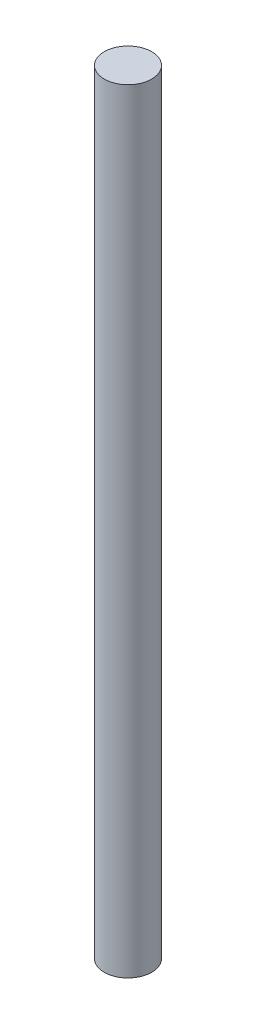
ISO-10303-21;
HEADER;
FILE_DESCRIPTION(('STEP AP214'),'2;1');
FILE_NAME('part.step','',(''),(''),'','','');
FILE_SCHEMA(('AUTOMOTIVE_DESIGN { 1 0 10303 214 1 1 1 1 }'));
ENDSEC;
DATA;
#1=APPLICATION_CONTEXT('core data for automotive mechanical design processes');
#2=APPLICATION_PROTOCOL_DEFINITION('international standard','automotive_design',2000,#1);
#3=PRODUCT_CONTEXT('',#1,'mechanical');
#4=PRODUCT('Part','Part','',(#3));
#5=PRODUCT_RELATED_PRODUCT_CATEGORY('part','',(#4));
#6=PRODUCT_DEFINITION_FORMATION('','',#4);
#7=PRODUCT_DEFINITION_CONTEXT('part definition',#1,'design');
#8=PRODUCT_DEFINITION('design','',#6,#7);
#9=PRODUCT_DEFINITION_SHAPE('','',#8);
#10=(LENGTH_UNIT() NAMED_UNIT(*) SI_UNIT(.MILLI.,.METRE.));
#11=(NAMED_UNIT(*) PLANE_ANGLE_UNIT() SI_UNIT($,.RADIAN.));
#12=(NAMED_UNIT(*) SI_UNIT($,.STERADIAN.) SOLID_ANGLE_UNIT());
#13=UNCERTAINTY_MEASURE_WITH_UNIT(LENGTH_MEASURE(1.E-05),#10,'distance_accuracy_value','');
#14=(GEOMETRIC_REPRESENTATION_CONTEXT(3) GLOBAL_UNCERTAINTY_ASSIGNED_CONTEXT((#13)) GLOBAL_UNIT_ASSIGNED_CONTEXT((#10,
#11,#12)) REPRESENTATION_CONTEXT('',''));
#15=CARTESIAN_POINT('',(0.,0.,0.));
#16=DIRECTION('',(0.,0.,1.));
#17=DIRECTION('',(1.,0.,0.));
#18=AXIS2_PLACEMENT_3D('',#15,#16,#17);
#19=CARTESIAN_POINT('',(0.,-103.505,0.));
#20=DIRECTION('',(0.,1.,0.));
#21=DIRECTION('',(0.,0.,1.));
#22=AXIS2_PLACEMENT_3D('',#19,#20,#21);
#23=CYLINDRICAL_SURFACE('',#22,3.175);
#24=CARTESIAN_POINT('',(0.,-103.505,0.));
#25=DIRECTION('',(0.,1.,0.));
#26=DIRECTION('',(0.,0.,1.));
#27=AXIS2_PLACEMENT_3D('',#24,#25,#26);
#28=CIRCLE('',#27,3.175);
#29=CARTESIAN_POINT('',(0.,-103.505,3.175));
#30=VERTEX_POINT('',#29);
#31=EDGE_CURVE('E10',#30,#30,#28,.T.);
#32=ORIENTED_EDGE('',*,*,#31,.T.);
#33=EDGE_LOOP('',(#32));
#34=FACE_BOUND('',#33,.T.);
#35=CARTESIAN_POINT('',(0.,0.,0.));
#36=DIRECTION('',(0.,1.,0.));
#37=DIRECTION('',(0.,0.,1.));
#38=AXIS2_PLACEMENT_3D('',#35,#36,#37);
#39=CIRCLE('',#38,3.175);
#40=CARTESIAN_POINT('',(0.,0.,3.175));
#41=VERTEX_POINT('',#40);
#42=EDGE_CURVE('E33',#41,#41,#39,.T.);
#43=ORIENTED_EDGE('',*,*,#42,.F.);
#44=EDGE_LOOP('',(#43));
#45=FACE_BOUND('',#44,.T.);
#46=ADVANCED_FACE('F30',(#34,#45),#23,.T.);
#47=CARTESIAN_POINT('',(0.,-103.505,0.));
#48=DIRECTION('',(0.,1.,0.));
#49=DIRECTION('',(0.,0.,1.));
#50=AXIS2_PLACEMENT_3D('',#47,#48,#49);
#51=PLANE('',#50);
#52=ORIENTED_EDGE('',*,*,#31,.F.);
#53=EDGE_LOOP('',(#52));
#54=FACE_BOUND('',#53,.T.);
#55=ADVANCED_FACE('F45',(#54),#51,.F.);
#56=CARTESIAN_POINT('',(0.,0.,0.));
#57=DIRECTION('',(0.,1.,0.));
#58=DIRECTION('',(0.,0.,1.));
#59=AXIS2_PLACEMENT_3D('',#56,#57,#58);
#60=PLANE('',#59);
#61=ORIENTED_EDGE('',*,*,#42,.T.);
#62=EDGE_LOOP('',(#61));
#63=FACE_BOUND('',#62,.T.);
#64=ADVANCED_FACE('F42',(#63),#60,.T.);
#65=CLOSED_SHELL('',(#46,#55,#64));
#66=MANIFOLD_SOLID_BREP('B2',#65);
#67=ADVANCED_BREP_SHAPE_REPRESENTATION('',(#18,#66),#14);
#68=SHAPE_DEFINITION_REPRESENTATION(#9,#67);
ENDSEC;
END-ISO-10303-21;
